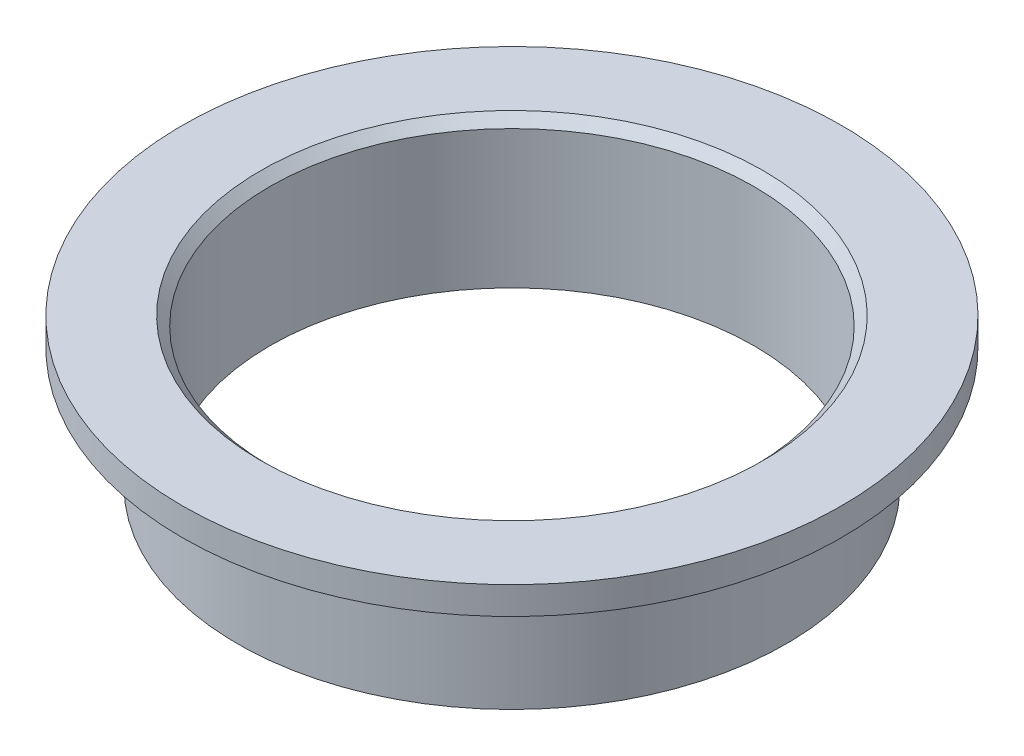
ISO-10303-21;
HEADER;
FILE_DESCRIPTION(('STEP AP214'),'2;1');
FILE_NAME('part.step','',(''),(''),'','','');
FILE_SCHEMA(('AUTOMOTIVE_DESIGN { 1 0 10303 214 1 1 1 1 }'));
ENDSEC;
DATA;
#1=APPLICATION_CONTEXT('core data for automotive mechanical design processes');
#2=APPLICATION_PROTOCOL_DEFINITION('international standard','automotive_design',2000,#1);
#3=PRODUCT_CONTEXT('',#1,'mechanical');
#4=PRODUCT('Part','Part','',(#3));
#5=PRODUCT_RELATED_PRODUCT_CATEGORY('part','',(#4));
#6=PRODUCT_DEFINITION_FORMATION('','',#4);
#7=PRODUCT_DEFINITION_CONTEXT('part definition',#1,'design');
#8=PRODUCT_DEFINITION('design','',#6,#7);
#9=PRODUCT_DEFINITION_SHAPE('','',#8);
#10=(LENGTH_UNIT() NAMED_UNIT(*) SI_UNIT(.MILLI.,.METRE.));
#11=(NAMED_UNIT(*) PLANE_ANGLE_UNIT() SI_UNIT($,.RADIAN.));
#12=(NAMED_UNIT(*) SI_UNIT($,.STERADIAN.) SOLID_ANGLE_UNIT());
#13=UNCERTAINTY_MEASURE_WITH_UNIT(LENGTH_MEASURE(1.E-05),#10,'distance_accuracy_value','');
#14=(GEOMETRIC_REPRESENTATION_CONTEXT(3) GLOBAL_UNCERTAINTY_ASSIGNED_CONTEXT((#13)) GLOBAL_UNIT_ASSIGNED_CONTEXT((#10,
#11,#12)) REPRESENTATION_CONTEXT('',''));
#15=CARTESIAN_POINT('',(0.,0.,0.));
#16=DIRECTION('',(0.,0.,1.));
#17=DIRECTION('',(1.,0.,0.));
#18=AXIS2_PLACEMENT_3D('',#15,#16,#17);
#19=CARTESIAN_POINT('',(0.,0.,0.));
#20=DIRECTION('',(0.,1.,0.));
#21=DIRECTION('',(0.,0.,1.));
#22=AXIS2_PLACEMENT_3D('',#19,#20,#21);
#23=PLANE('',#22);
#24=CARTESIAN_POINT('',(0.,0.,0.));
#25=DIRECTION('',(0.,1.,0.));
#26=DIRECTION('',(0.,0.,1.));
#27=AXIS2_PLACEMENT_3D('',#24,#25,#26);
#28=CIRCLE('',#27,7.46);
#29=CARTESIAN_POINT('',(0.,0.,-7.46));
#30=VERTEX_POINT('',#29);
#31=EDGE_CURVE('E47',#30,#30,#28,.T.);
#32=ORIENTED_EDGE('',*,*,#31,.F.);
#33=EDGE_LOOP('',(#32));
#34=FACE_BOUND('',#33,.T.);
#35=CARTESIAN_POINT('',(0.,0.,0.));
#36=DIRECTION('',(0.,1.,0.));
#37=DIRECTION('',(0.,0.,1.));
#38=AXIS2_PLACEMENT_3D('',#35,#36,#37);
#39=CIRCLE('',#38,6.58);
#40=CARTESIAN_POINT('',(0.,0.,-6.58));
#41=VERTEX_POINT('',#40);
#42=EDGE_CURVE('E51',#41,#41,#39,.T.);
#43=ORIENTED_EDGE('',*,*,#42,.T.);
#44=EDGE_LOOP('',(#43));
#45=FACE_BOUND('',#44,.T.);
#46=ADVANCED_FACE('F32',(#34,#45),#23,.F.);
#47=CARTESIAN_POINT('',(0.,3.25,0.));
#48=DIRECTION('',(0.,-1.,0.));
#49=DIRECTION('',(0.,0.,-1.));
#50=AXIS2_PLACEMENT_3D('',#47,#48,#49);
#51=CYLINDRICAL_SURFACE('',#50,7.46);
#52=CARTESIAN_POINT('',(0.,3.25,0.));
#53=DIRECTION('',(0.,1.,0.));
#54=DIRECTION('',(0.,0.,1.));
#55=AXIS2_PLACEMENT_3D('',#52,#53,#54);
#56=CIRCLE('',#55,7.46);
#57=CARTESIAN_POINT('',(0.,3.25,-7.46));
#58=VERTEX_POINT('',#57);
#59=EDGE_CURVE('E43',#58,#58,#56,.T.);
#60=CARTESIAN_POINT('',(0.,3.25,-7.46));
#61=CARTESIAN_POINT('',(0.,3.21614583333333,-7.46));
#62=CARTESIAN_POINT('',(0.,3.18229166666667,-7.46));
#63=CARTESIAN_POINT('',(0.,3.11458333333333,-7.46));
#64=CARTESIAN_POINT('',(0.,3.08072916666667,-7.46));
#65=CARTESIAN_POINT('',(0.,3.01302083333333,-7.46));
#66=CARTESIAN_POINT('',(0.,2.97916666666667,-7.46));
#67=CARTESIAN_POINT('',(0.,2.91145833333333,-7.46));
#68=CARTESIAN_POINT('',(0.,2.87760416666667,-7.46));
#69=CARTESIAN_POINT('',(0.,2.80989583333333,-7.46));
#70=CARTESIAN_POINT('',(0.,2.77604166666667,-7.46));
#71=CARTESIAN_POINT('',(0.,2.70833333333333,-7.46));
#72=CARTESIAN_POINT('',(0.,2.67447916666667,-7.46));
#73=CARTESIAN_POINT('',(0.,2.60677083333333,-7.46));
#74=CARTESIAN_POINT('',(0.,2.57291666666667,-7.46));
#75=CARTESIAN_POINT('',(0.,2.50520833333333,-7.46));
#76=CARTESIAN_POINT('',(0.,2.47135416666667,-7.46));
#77=CARTESIAN_POINT('',(0.,2.40364583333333,-7.46));
#78=CARTESIAN_POINT('',(0.,2.36979166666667,-7.46));
#79=CARTESIAN_POINT('',(0.,2.30208333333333,-7.46));
#80=CARTESIAN_POINT('',(0.,2.26822916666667,-7.46));
#81=CARTESIAN_POINT('',(0.,2.20052083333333,-7.46));
#82=CARTESIAN_POINT('',(0.,2.16666666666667,-7.46));
#83=CARTESIAN_POINT('',(0.,2.09895833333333,-7.46));
#84=CARTESIAN_POINT('',(0.,2.06510416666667,-7.46));
#85=CARTESIAN_POINT('',(0.,1.99739583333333,-7.46));
#86=CARTESIAN_POINT('',(0.,1.96354166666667,-7.46));
#87=CARTESIAN_POINT('',(0.,1.89583333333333,-7.46));
#88=CARTESIAN_POINT('',(0.,1.86197916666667,-7.46));
#89=CARTESIAN_POINT('',(0.,1.79427083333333,-7.46));
#90=CARTESIAN_POINT('',(0.,1.76041666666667,-7.46));
#91=CARTESIAN_POINT('',(0.,1.69270833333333,-7.46));
#92=CARTESIAN_POINT('',(0.,1.65885416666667,-7.46));
#93=CARTESIAN_POINT('',(0.,1.59114583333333,-7.46));
#94=CARTESIAN_POINT('',(0.,1.55729166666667,-7.46));
#95=CARTESIAN_POINT('',(0.,1.48958333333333,-7.46));
#96=CARTESIAN_POINT('',(0.,1.45572916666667,-7.46));
#97=CARTESIAN_POINT('',(0.,1.38802083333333,-7.46));
#98=CARTESIAN_POINT('',(0.,1.35416666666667,-7.46));
#99=CARTESIAN_POINT('',(0.,1.28645833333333,-7.46));
#100=CARTESIAN_POINT('',(0.,1.25260416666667,-7.46));
#101=CARTESIAN_POINT('',(0.,1.18489583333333,-7.46));
#102=CARTESIAN_POINT('',(0.,1.15104166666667,-7.46));
#103=CARTESIAN_POINT('',(0.,1.08333333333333,-7.46));
#104=CARTESIAN_POINT('',(0.,1.04947916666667,-7.46));
#105=CARTESIAN_POINT('',(0.,0.981770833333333,-7.46));
#106=CARTESIAN_POINT('',(0.,0.947916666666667,-7.46));
#107=CARTESIAN_POINT('',(0.,0.880208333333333,-7.46));
#108=CARTESIAN_POINT('',(0.,0.846354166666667,-7.46));
#109=CARTESIAN_POINT('',(0.,0.778645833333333,-7.46));
#110=CARTESIAN_POINT('',(0.,0.744791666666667,-7.46));
#111=CARTESIAN_POINT('',(0.,0.677083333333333,-7.46));
#112=CARTESIAN_POINT('',(0.,0.643229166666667,-7.46));
#113=CARTESIAN_POINT('',(0.,0.575520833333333,-7.46));
#114=CARTESIAN_POINT('',(0.,0.541666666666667,-7.46));
#115=CARTESIAN_POINT('',(0.,0.473958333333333,-7.46));
#116=CARTESIAN_POINT('',(0.,0.440104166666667,-7.46));
#117=CARTESIAN_POINT('',(0.,0.372395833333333,-7.46));
#118=CARTESIAN_POINT('',(0.,0.338541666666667,-7.46));
#119=CARTESIAN_POINT('',(0.,0.270833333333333,-7.46));
#120=CARTESIAN_POINT('',(0.,0.236979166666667,-7.46));
#121=CARTESIAN_POINT('',(0.,0.169270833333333,-7.46));
#122=CARTESIAN_POINT('',(0.,0.135416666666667,-7.46));
#123=CARTESIAN_POINT('',(0.,0.0677083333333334,-7.46));
#124=CARTESIAN_POINT('',(0.,0.0338541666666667,-7.46));
#125=CARTESIAN_POINT('',(0.,0.,-7.46));
#126=B_SPLINE_CURVE_WITH_KNOTS('',3,(#60,#61,#62,#63,#64,#65,#66,#67,#68,#69,#70,#71,#72,#73,
#74,#75,#76,#77,#78,#79,#80,#81,#82,#83,#84,#85,#86,#87,#88,#89,#90,#91,#92,#93,#94,#95,#96,#97,
#98,#99,#100,#101,#102,#103,#104,#105,#106,#107,#108,#109,#110,#111,#112,#113,#114,#115,#116,
#117,#118,#119,#120,#121,#122,#123,#124,#125),.UNSPECIFIED.,.F.,.F.,(4,2,2,2,2,2,2,2,2,2,2,2,2,
2,2,2,2,2,2,2,2,2,2,2,2,2,2,2,2,2,2,2,4),(0.,0.1015625,0.203125,0.3046875,0.40625,0.5078125,
0.609375,0.7109375,0.8125,0.9140625,1.015625,1.1171875,1.21875,1.3203125,1.421875,1.5234375,
1.625,1.7265625,1.828125,1.9296875,2.03125,2.1328125,2.234375,2.3359375,2.4375,2.5390625,
2.640625,2.7421875,2.84375,2.9453125,3.046875,3.1484375,3.25),.UNSPECIFIED.);
#127=EDGE_CURVE('BSEAM77',#58,#30,#126,.T.);
#128=ORIENTED_EDGE('',*,*,#59,.F.);
#129=ORIENTED_EDGE('',*,*,#31,.T.);
#130=ORIENTED_EDGE('',*,*,#127,.T.);
#131=ORIENTED_EDGE('',*,*,#127,.F.);
#132=EDGE_LOOP('',(#128,#130,#129,#131));
#133=FACE_BOUND('',#132,.T.);
#134=ADVANCED_FACE('F77',(#133),#51,.T.);
#135=CARTESIAN_POINT('',(0.,3.25,0.));
#136=DIRECTION('',(0.,-1.,0.));
#137=DIRECTION('',(0.,0.,-1.));
#138=AXIS2_PLACEMENT_3D('',#135,#136,#137);
#139=CYLINDRICAL_SURFACE('',#138,6.58);
#140=CARTESIAN_POINT('',(0.,3.74999999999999,0.));
#141=DIRECTION('',(0.,1.,0.));
#142=DIRECTION('',(0.,0.,1.));
#143=AXIS2_PLACEMENT_3D('',#140,#141,#142);
#144=CIRCLE('',#143,6.58);
#145=CARTESIAN_POINT('',(0.,3.74999999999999,-6.58));
#146=VERTEX_POINT('',#145);
#147=EDGE_CURVE('E39',#146,#146,#144,.T.);
#148=CARTESIAN_POINT('',(0.,3.74999999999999,-6.58));
#149=CARTESIAN_POINT('',(0.,3.71093749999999,-6.58));
#150=CARTESIAN_POINT('',(0.,3.67187499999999,-6.58));
#151=CARTESIAN_POINT('',(0.,3.59374999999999,-6.58));
#152=CARTESIAN_POINT('',(0.,3.55468749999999,-6.58));
#153=CARTESIAN_POINT('',(0.,3.47656249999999,-6.58));
#154=CARTESIAN_POINT('',(0.,3.43749999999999,-6.58));
#155=CARTESIAN_POINT('',(0.,3.35937499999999,-6.58));
#156=CARTESIAN_POINT('',(0.,3.32031249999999,-6.58));
#157=CARTESIAN_POINT('',(0.,3.24218749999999,-6.58));
#158=CARTESIAN_POINT('',(0.,3.20312499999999,-6.58));
#159=CARTESIAN_POINT('',(0.,3.12499999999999,-6.58));
#160=CARTESIAN_POINT('',(0.,3.08593749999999,-6.58));
#161=CARTESIAN_POINT('',(0.,3.00781249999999,-6.58));
#162=CARTESIAN_POINT('',(0.,2.96874999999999,-6.58));
#163=CARTESIAN_POINT('',(0.,2.89062499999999,-6.58));
#164=CARTESIAN_POINT('',(0.,2.85156249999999,-6.58));
#165=CARTESIAN_POINT('',(0.,2.77343749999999,-6.58));
#166=CARTESIAN_POINT('',(0.,2.73437499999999,-6.58));
#167=CARTESIAN_POINT('',(0.,2.65624999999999,-6.58));
#168=CARTESIAN_POINT('',(0.,2.61718749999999,-6.58));
#169=CARTESIAN_POINT('',(0.,2.53906249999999,-6.58));
#170=CARTESIAN_POINT('',(0.,2.49999999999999,-6.58));
#171=CARTESIAN_POINT('',(0.,2.42187499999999,-6.58));
#172=CARTESIAN_POINT('',(0.,2.38281249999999,-6.58));
#173=CARTESIAN_POINT('',(0.,2.30468749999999,-6.58));
#174=CARTESIAN_POINT('',(0.,2.26562499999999,-6.58));
#175=CARTESIAN_POINT('',(0.,2.18749999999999,-6.58));
#176=CARTESIAN_POINT('',(0.,2.14843749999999,-6.58));
#177=CARTESIAN_POINT('',(0.,2.07031249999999,-6.58));
#178=CARTESIAN_POINT('',(0.,2.03124999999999,-6.58));
#179=CARTESIAN_POINT('',(0.,1.95312499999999,-6.58));
#180=CARTESIAN_POINT('',(0.,1.91406249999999,-6.58));
#181=CARTESIAN_POINT('',(0.,1.83593749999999,-6.58));
#182=CARTESIAN_POINT('',(0.,1.79687499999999,-6.58));
#183=CARTESIAN_POINT('',(0.,1.71874999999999,-6.58));
#184=CARTESIAN_POINT('',(0.,1.67968749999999,-6.58));
#185=CARTESIAN_POINT('',(0.,1.6015625,-6.58));
#186=CARTESIAN_POINT('',(0.,1.5625,-6.58));
#187=CARTESIAN_POINT('',(0.,1.484375,-6.58));
#188=CARTESIAN_POINT('',(0.,1.4453125,-6.58));
#189=CARTESIAN_POINT('',(0.,1.3671875,-6.58));
#190=CARTESIAN_POINT('',(0.,1.328125,-6.58));
#191=CARTESIAN_POINT('',(0.,1.25,-6.58));
#192=CARTESIAN_POINT('',(0.,1.2109375,-6.58));
#193=CARTESIAN_POINT('',(0.,1.1328125,-6.58));
#194=CARTESIAN_POINT('',(0.,1.09375,-6.58));
#195=CARTESIAN_POINT('',(0.,1.015625,-6.58));
#196=CARTESIAN_POINT('',(0.,0.976562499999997,-6.58));
#197=CARTESIAN_POINT('',(0.,0.898437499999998,-6.58));
#198=CARTESIAN_POINT('',(0.,0.859374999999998,-6.58));
#199=CARTESIAN_POINT('',(0.,0.781249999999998,-6.58));
#200=CARTESIAN_POINT('',(0.,0.742187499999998,-6.58));
#201=CARTESIAN_POINT('',(0.,0.664062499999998,-6.58));
#202=CARTESIAN_POINT('',(0.,0.624999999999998,-6.58));
#203=CARTESIAN_POINT('',(0.,0.546874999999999,-6.58));
#204=CARTESIAN_POINT('',(0.,0.507812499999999,-6.58));
#205=CARTESIAN_POINT('',(0.,0.429687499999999,-6.58));
#206=CARTESIAN_POINT('',(0.,0.390624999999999,-6.58));
#207=CARTESIAN_POINT('',(0.,0.312499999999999,-6.58));
#208=CARTESIAN_POINT('',(0.,0.273437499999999,-6.58));
#209=CARTESIAN_POINT('',(0.,0.1953125,-6.58));
#210=CARTESIAN_POINT('',(0.,0.15625,-6.58));
#211=CARTESIAN_POINT('',(0.,0.078125,-6.58));
#212=CARTESIAN_POINT('',(0.,0.0390625,-6.58));
#213=CARTESIAN_POINT('',(0.,0.,-6.58));
#214=B_SPLINE_CURVE_WITH_KNOTS('',3,(#148,#149,#150,#151,#152,#153,#154,#155,#156,#157,#158,
#159,#160,#161,#162,#163,#164,#165,#166,#167,#168,#169,#170,#171,#172,#173,#174,#175,#176,#177,
#178,#179,#180,#181,#182,#183,#184,#185,#186,#187,#188,#189,#190,#191,#192,#193,#194,#195,#196,
#197,#198,#199,#200,#201,#202,#203,#204,#205,#206,#207,#208,#209,#210,#211,#212,#213),
.UNSPECIFIED.,.F.,.F.,(4,2,2,2,2,2,2,2,2,2,2,2,2,2,2,2,2,2,2,2,2,2,2,2,2,2,2,2,2,2,2,2,4),(0.,
0.1171875,0.234374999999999,0.351562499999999,0.468749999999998,0.585937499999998,
0.703124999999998,0.820312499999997,0.937499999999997,1.0546875,1.171875,1.2890625,1.40625,
1.52343749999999,1.64062499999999,1.75781249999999,1.87499999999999,1.99218749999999,
2.10937499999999,2.22656249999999,2.34374999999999,2.46093749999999,2.57812499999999,
2.69531249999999,2.81249999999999,2.92968749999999,3.04687499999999,3.16406249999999,
3.28124999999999,3.39843749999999,3.51562499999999,3.63281249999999,3.74999999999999),.UNSPECIFIED.);
#215=EDGE_CURVE('BSEAM73',#146,#41,#214,.T.);
#216=ORIENTED_EDGE('',*,*,#147,.T.);
#217=ORIENTED_EDGE('',*,*,#42,.F.);
#218=ORIENTED_EDGE('',*,*,#215,.T.);
#219=ORIENTED_EDGE('',*,*,#215,.F.);
#220=EDGE_LOOP('',(#216,#218,#217,#219));
#221=FACE_BOUND('',#220,.T.);
#222=ADVANCED_FACE('F73',(#221),#139,.F.);
#223=CARTESIAN_POINT('',(0.,3.25,0.));
#224=DIRECTION('',(0.,1.,0.));
#225=DIRECTION('',(0.,0.,1.));
#226=AXIS2_PLACEMENT_3D('',#223,#224,#225);
#227=PLANE('',#226);
#228=CARTESIAN_POINT('',(0.,3.25,0.));
#229=DIRECTION('',(0.,1.,0.));
#230=DIRECTION('',(0.,0.,1.));
#231=AXIS2_PLACEMENT_3D('',#228,#229,#230);
#232=CIRCLE('',#231,8.96);
#233=CARTESIAN_POINT('',(0.,3.25,8.96));
#234=VERTEX_POINT('',#233);
#235=EDGE_CURVE('E56',#234,#234,#232,.T.);
#236=ORIENTED_EDGE('',*,*,#235,.F.);
#237=EDGE_LOOP('',(#236));
#238=FACE_BOUND('',#237,.T.);
#239=ORIENTED_EDGE('',*,*,#59,.T.);
#240=EDGE_LOOP('',(#239));
#241=FACE_BOUND('',#240,.T.);
#242=ADVANCED_FACE('F70',(#238,#241),#227,.F.);
#243=CARTESIAN_POINT('',(0.,4.,0.));
#244=DIRECTION('',(0.,1.,0.));
#245=DIRECTION('',(0.,0.,1.));
#246=AXIS2_PLACEMENT_3D('',#243,#244,#245);
#247=PLANE('',#246);
#248=CARTESIAN_POINT('',(0.,4.,0.));
#249=DIRECTION('',(0.,1.,0.));
#250=DIRECTION('',(0.,0.,1.));
#251=AXIS2_PLACEMENT_3D('',#248,#249,#250);
#252=CIRCLE('',#251,6.83000000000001);
#253=CARTESIAN_POINT('',(0.,4.,6.83000000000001));
#254=VERTEX_POINT('',#253);
#255=EDGE_CURVE('E10',#254,#254,#252,.F.);
#256=ORIENTED_EDGE('',*,*,#255,.T.);
#257=EDGE_LOOP('',(#256));
#258=FACE_BOUND('',#257,.T.);
#259=CARTESIAN_POINT('',(0.,4.,0.));
#260=DIRECTION('',(0.,1.,0.));
#261=DIRECTION('',(0.,0.,1.));
#262=AXIS2_PLACEMENT_3D('',#259,#260,#261);
#263=CIRCLE('',#262,8.96);
#264=CARTESIAN_POINT('',(0.,4.,8.96));
#265=VERTEX_POINT('',#264);
#266=EDGE_CURVE('E55',#265,#265,#263,.T.);
#267=ORIENTED_EDGE('',*,*,#266,.T.);
#268=EDGE_LOOP('',(#267));
#269=FACE_BOUND('',#268,.T.);
#270=ADVANCED_FACE('F62',(#258,#269),#247,.T.);
#271=CARTESIAN_POINT('',(0.,4.,0.));
#272=DIRECTION('',(0.,-1.,0.));
#273=DIRECTION('',(0.,0.,-1.));
#274=AXIS2_PLACEMENT_3D('',#271,#272,#273);
#275=CYLINDRICAL_SURFACE('',#274,8.96);
#276=ORIENTED_EDGE('',*,*,#266,.F.);
#277=EDGE_LOOP('',(#276));
#278=FACE_BOUND('',#277,.T.);
#279=ORIENTED_EDGE('',*,*,#235,.T.);
#280=EDGE_LOOP('',(#279));
#281=FACE_BOUND('',#280,.T.);
#282=ADVANCED_FACE('F64',(#278,#281),#275,.T.);
#283=CARTESIAN_POINT('',(0.,3.74999999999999,0.));
#284=DIRECTION('',(0.,1.,0.));
#285=DIRECTION('',(0.,0.,1.));
#286=AXIS2_PLACEMENT_3D('',#283,#284,#285);
#287=CONICAL_SURFACE('',#286,6.58,0.78539816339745);
#288=ORIENTED_EDGE('',*,*,#255,.F.);
#289=EDGE_LOOP('',(#288));
#290=FACE_BOUND('',#289,.T.);
#291=ORIENTED_EDGE('',*,*,#147,.F.);
#292=EDGE_LOOP('',(#291));
#293=FACE_BOUND('',#292,.T.);
#294=ADVANCED_FACE('F34',(#290,#293),#287,.F.);
#295=CLOSED_SHELL('',(#46,#134,#222,#242,#270,#282,#294));
#296=MANIFOLD_SOLID_BREP('B2',#295);
#297=ADVANCED_BREP_SHAPE_REPRESENTATION('',(#18,#296),#14);
#298=SHAPE_DEFINITION_REPRESENTATION(#9,#297);
ENDSEC;
END-ISO-10303-21;
